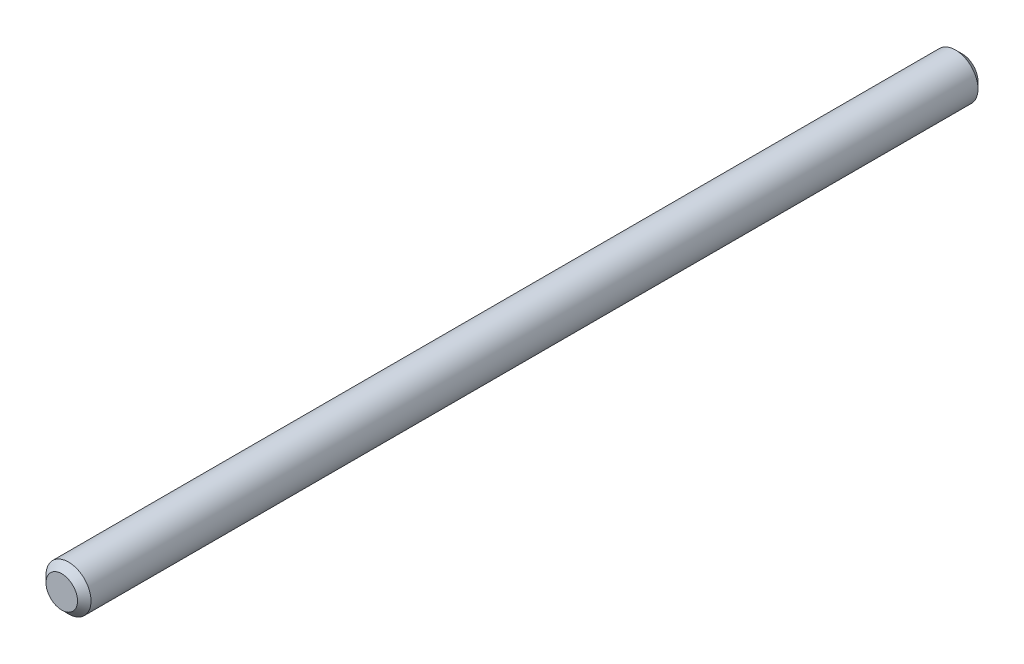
from build123d import *

# Parameters (mm, degrees)
ESQUISSE1_R          = 1
BASE_EXTRUSION_DEPTH = 40
CHANFREIN1_SIZE      = 0.3


with BuildPart() as part:
    # Esquisse1 → Base-Extrusion (new body)
    with BuildSketch(Plane.XY):
        Circle(ESQUISSE1_R)
    extrude(amount=BASE_EXTRUSION_DEPTH)

    # Chanfrein1
    chanfrein1_edges = [part.edges().sort_by_distance(p)[0] for p in [
        (-1, 0, 0),
        (-1, 0, 40),
    ]]
    chamfer(chanfrein1_edges, length=CHANFREIN1_SIZE)


solid = part.part
